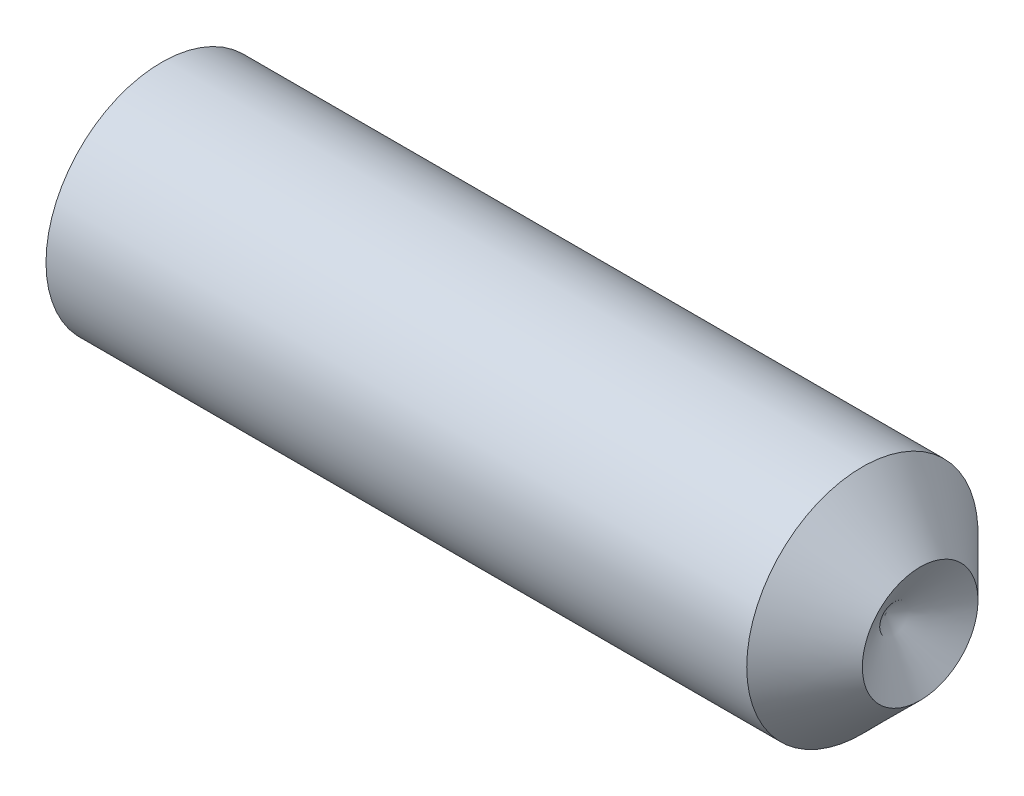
from build123d import *

# Parameters (mm, degrees)
HEX_2_DEPTH = 3


with BuildPart() as part:
    # BodySke → BaseBody (revolve)
    with BuildSketch(Plane.XY, mode=Mode.PRIVATE) as basebody_sk:
        Polygon((0, 0), (0, 2.4455), (0.320140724, 3), (18.5, 3), (20, 1.5), (19.098709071, 0), align=None)
    revolve(basebody_sk.sketch.rotate(Axis((-12.7, 0, 0), (1, 0, 0)), 90), axis=Axis((-12.7, 0, 0), (1, 0, 0)))

    # Sketch2 → Hex 2 (cut)
    with BuildSketch(Plane.ZY):
        Polygon((0.866025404, 1.5), (-0.866025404, 1.5), (-1.732050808, 0), (-0.866025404, -1.5), (0.866025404, -1.5), (1.732050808, 0), align=None)
    extrude(amount=-HEX_2_DEPTH, mode=Mode.SUBTRACT)


solid = part.part
